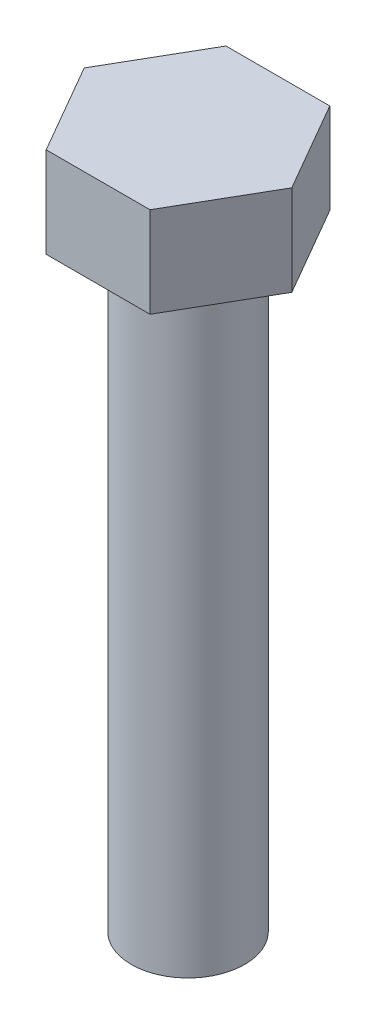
ISO-10303-21;
HEADER;
FILE_DESCRIPTION(('STEP AP214'),'2;1');
FILE_NAME('part.step','',(''),(''),'','','');
FILE_SCHEMA(('AUTOMOTIVE_DESIGN { 1 0 10303 214 1 1 1 1 }'));
ENDSEC;
DATA;
#1=APPLICATION_CONTEXT('core data for automotive mechanical design processes');
#2=APPLICATION_PROTOCOL_DEFINITION('international standard','automotive_design',2000,#1);
#3=PRODUCT_CONTEXT('',#1,'mechanical');
#4=PRODUCT('Part','Part','',(#3));
#5=PRODUCT_RELATED_PRODUCT_CATEGORY('part','',(#4));
#6=PRODUCT_DEFINITION_FORMATION('','',#4);
#7=PRODUCT_DEFINITION_CONTEXT('part definition',#1,'design');
#8=PRODUCT_DEFINITION('design','',#6,#7);
#9=PRODUCT_DEFINITION_SHAPE('','',#8);
#10=(LENGTH_UNIT() NAMED_UNIT(*) SI_UNIT(.MILLI.,.METRE.));
#11=(NAMED_UNIT(*) PLANE_ANGLE_UNIT() SI_UNIT($,.RADIAN.));
#12=(NAMED_UNIT(*) SI_UNIT($,.STERADIAN.) SOLID_ANGLE_UNIT());
#13=UNCERTAINTY_MEASURE_WITH_UNIT(LENGTH_MEASURE(1.E-05),#10,'distance_accuracy_value','');
#14=(GEOMETRIC_REPRESENTATION_CONTEXT(3) GLOBAL_UNCERTAINTY_ASSIGNED_CONTEXT((#13)) GLOBAL_UNIT_ASSIGNED_CONTEXT((#10,
#11,#12)) REPRESENTATION_CONTEXT('',''));
#15=CARTESIAN_POINT('',(0.,0.,0.));
#16=DIRECTION('',(0.,0.,1.));
#17=DIRECTION('',(1.,0.,0.));
#18=AXIS2_PLACEMENT_3D('',#15,#16,#17);
#19=CARTESIAN_POINT('',(-17.4143274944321,30.3784,30.1625));
#20=DIRECTION('',(0.,0.,-1.));
#21=DIRECTION('',(-1.,0.,0.));
#22=AXIS2_PLACEMENT_3D('',#19,#20,#21);
#23=PLANE('',#22);
#24=DIRECTION('',(1.,0.,0.));
#25=VECTOR('',#24,1.);
#26=CARTESIAN_POINT('',(-17.4143274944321,0.,30.1625));
#27=LINE('',#26,#25);
#28=CARTESIAN_POINT('',(-17.4143274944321,0.,30.1625));
#29=VERTEX_POINT('',#28);
#30=CARTESIAN_POINT('',(17.4143274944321,0.,30.1625));
#31=VERTEX_POINT('',#30);
#32=EDGE_CURVE('E118',#29,#31,#27,.T.);
#33=ORIENTED_EDGE('',*,*,#32,.T.);
#34=DIRECTION('',(0.,-1.,0.));
#35=VECTOR('',#34,1.);
#36=CARTESIAN_POINT('',(17.4143274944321,30.3784,30.1625));
#37=LINE('',#36,#35);
#38=CARTESIAN_POINT('',(17.4143274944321,30.3784,30.1625));
#39=VERTEX_POINT('',#38);
#40=EDGE_CURVE('E11',#39,#31,#37,.T.);
#41=ORIENTED_EDGE('',*,*,#40,.F.);
#42=DIRECTION('',(1.,0.,0.));
#43=VECTOR('',#42,1.);
#44=CARTESIAN_POINT('',(-17.4143274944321,30.3784,30.1625));
#45=LINE('',#44,#43);
#46=CARTESIAN_POINT('',(-17.4143274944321,30.3784,30.1625));
#47=VERTEX_POINT('',#46);
#48=EDGE_CURVE('E129',#47,#39,#45,.T.);
#49=ORIENTED_EDGE('',*,*,#48,.F.);
#50=DIRECTION('',(0.,-1.,0.));
#51=VECTOR('',#50,1.);
#52=CARTESIAN_POINT('',(-17.4143274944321,30.3784,30.1625));
#53=LINE('',#52,#51);
#54=EDGE_CURVE('E114',#47,#29,#53,.T.);
#55=ORIENTED_EDGE('',*,*,#54,.T.);
#56=EDGE_LOOP('',(#33,#41,#49,#55));
#57=FACE_BOUND('',#56,.T.);
#58=ADVANCED_FACE('F34',(#57),#23,.F.);
#59=CARTESIAN_POINT('',(17.4143274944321,30.3784,30.1625));
#60=DIRECTION('',(-0.866025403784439,0.,-0.5));
#61=DIRECTION('',(-0.5,0.,0.866025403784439));
#62=AXIS2_PLACEMENT_3D('',#59,#60,#61);
#63=PLANE('',#62);
#64=DIRECTION('',(0.5,0.,-0.866025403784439));
#65=VECTOR('',#64,1.);
#66=CARTESIAN_POINT('',(17.4143274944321,0.,30.1625));
#67=LINE('',#66,#65);
#68=CARTESIAN_POINT('',(34.8286549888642,0.,0.));
#69=VERTEX_POINT('',#68);
#70=EDGE_CURVE('E121',#31,#69,#67,.T.);
#71=ORIENTED_EDGE('',*,*,#70,.T.);
#72=DIRECTION('',(0.,-1.,0.));
#73=VECTOR('',#72,1.);
#74=CARTESIAN_POINT('',(34.8286549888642,30.3784,0.));
#75=LINE('',#74,#73);
#76=CARTESIAN_POINT('',(34.8286549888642,30.3784,0.));
#77=VERTEX_POINT('',#76);
#78=EDGE_CURVE('E42',#77,#69,#75,.T.);
#79=ORIENTED_EDGE('',*,*,#78,.F.);
#80=DIRECTION('',(0.5,0.,-0.866025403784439));
#81=VECTOR('',#80,1.);
#82=CARTESIAN_POINT('',(17.4143274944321,30.3784,30.1625));
#83=LINE('',#82,#81);
#84=EDGE_CURVE('E87',#39,#77,#83,.T.);
#85=ORIENTED_EDGE('',*,*,#84,.F.);
#86=ORIENTED_EDGE('',*,*,#40,.T.);
#87=EDGE_LOOP('',(#71,#79,#85,#86));
#88=FACE_BOUND('',#87,.T.);
#89=ADVANCED_FACE('F153',(#88),#63,.F.);
#90=CARTESIAN_POINT('',(34.8286549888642,30.3784,0.));
#91=DIRECTION('',(-0.866025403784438,0.,0.5));
#92=DIRECTION('',(0.5,0.,0.866025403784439));
#93=AXIS2_PLACEMENT_3D('',#90,#91,#92);
#94=PLANE('',#93);
#95=DIRECTION('',(-0.5,0.,-0.866025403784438));
#96=VECTOR('',#95,1.);
#97=CARTESIAN_POINT('',(34.8286549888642,0.,0.));
#98=LINE('',#97,#96);
#99=CARTESIAN_POINT('',(17.4143274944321,0.,-30.1625));
#100=VERTEX_POINT('',#99);
#101=EDGE_CURVE('E124',#69,#100,#98,.T.);
#102=ORIENTED_EDGE('',*,*,#101,.T.);
#103=DIRECTION('',(0.,-1.,0.));
#104=VECTOR('',#103,1.);
#105=CARTESIAN_POINT('',(17.4143274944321,30.3784,-30.1625));
#106=LINE('',#105,#104);
#107=CARTESIAN_POINT('',(17.4143274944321,30.3784,-30.1625));
#108=VERTEX_POINT('',#107);
#109=EDGE_CURVE('E109',#108,#100,#106,.T.);
#110=ORIENTED_EDGE('',*,*,#109,.F.);
#111=DIRECTION('',(-0.5,0.,-0.866025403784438));
#112=VECTOR('',#111,1.);
#113=CARTESIAN_POINT('',(34.8286549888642,30.3784,0.));
#114=LINE('',#113,#112);
#115=EDGE_CURVE('E100',#77,#108,#114,.T.);
#116=ORIENTED_EDGE('',*,*,#115,.F.);
#117=ORIENTED_EDGE('',*,*,#78,.T.);
#118=EDGE_LOOP('',(#102,#110,#116,#117));
#119=FACE_BOUND('',#118,.T.);
#120=ADVANCED_FACE('F135',(#119),#94,.F.);
#121=CARTESIAN_POINT('',(17.4143274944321,30.3784,-30.1625));
#122=DIRECTION('',(0.,0.,1.));
#123=DIRECTION('',(1.,0.,0.));
#124=AXIS2_PLACEMENT_3D('',#121,#122,#123);
#125=PLANE('',#124);
#126=DIRECTION('',(-1.,0.,0.));
#127=VECTOR('',#126,1.);
#128=CARTESIAN_POINT('',(17.4143274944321,0.,-30.1625));
#129=LINE('',#128,#127);
#130=CARTESIAN_POINT('',(-17.4143274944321,0.,-30.1625));
#131=VERTEX_POINT('',#130);
#132=EDGE_CURVE('E108',#100,#131,#129,.T.);
#133=ORIENTED_EDGE('',*,*,#132,.T.);
#134=DIRECTION('',(0.,-1.,0.));
#135=VECTOR('',#134,1.);
#136=CARTESIAN_POINT('',(-17.4143274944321,30.3784,-30.1625));
#137=LINE('',#136,#135);
#138=CARTESIAN_POINT('',(-17.4143274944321,30.3784,-30.1625));
#139=VERTEX_POINT('',#138);
#140=EDGE_CURVE('E105',#139,#131,#137,.T.);
#141=ORIENTED_EDGE('',*,*,#140,.F.);
#142=DIRECTION('',(-1.,0.,0.));
#143=VECTOR('',#142,1.);
#144=CARTESIAN_POINT('',(17.4143274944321,30.3784,-30.1625));
#145=LINE('',#144,#143);
#146=EDGE_CURVE('E94',#108,#139,#145,.T.);
#147=ORIENTED_EDGE('',*,*,#146,.F.);
#148=ORIENTED_EDGE('',*,*,#109,.T.);
#149=EDGE_LOOP('',(#133,#141,#147,#148));
#150=FACE_BOUND('',#149,.T.);
#151=ADVANCED_FACE('F106',(#150),#125,.F.);
#152=CARTESIAN_POINT('',(-17.4143274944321,30.3784,-30.1625));
#153=DIRECTION('',(0.866025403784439,0.,0.5));
#154=DIRECTION('',(0.5,0.,-0.866025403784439));
#155=AXIS2_PLACEMENT_3D('',#152,#153,#154);
#156=PLANE('',#155);
#157=DIRECTION('',(-0.5,0.,0.866025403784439));
#158=VECTOR('',#157,1.);
#159=CARTESIAN_POINT('',(-17.4143274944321,0.,-30.1625));
#160=LINE('',#159,#158);
#161=CARTESIAN_POINT('',(-34.8286549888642,0.,0.));
#162=VERTEX_POINT('',#161);
#163=EDGE_CURVE('E73',#131,#162,#160,.T.);
#164=ORIENTED_EDGE('',*,*,#163,.T.);
#165=DIRECTION('',(0.,-1.,0.));
#166=VECTOR('',#165,1.);
#167=CARTESIAN_POINT('',(-34.8286549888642,30.3784,0.));
#168=LINE('',#167,#166);
#169=CARTESIAN_POINT('',(-34.8286549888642,30.3784,0.));
#170=VERTEX_POINT('',#169);
#171=EDGE_CURVE('E110',#170,#162,#168,.T.);
#172=ORIENTED_EDGE('',*,*,#171,.F.);
#173=DIRECTION('',(-0.5,0.,0.866025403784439));
#174=VECTOR('',#173,1.);
#175=CARTESIAN_POINT('',(-17.4143274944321,30.3784,-30.1625));
#176=LINE('',#175,#174);
#177=EDGE_CURVE('E98',#139,#170,#176,.T.);
#178=ORIENTED_EDGE('',*,*,#177,.F.);
#179=ORIENTED_EDGE('',*,*,#140,.T.);
#180=EDGE_LOOP('',(#164,#172,#178,#179));
#181=FACE_BOUND('',#180,.T.);
#182=ADVANCED_FACE('F112',(#181),#156,.F.);
#183=CARTESIAN_POINT('',(-34.8286549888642,30.3784,0.));
#184=DIRECTION('',(0.866025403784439,0.,-0.5));
#185=DIRECTION('',(-0.5,0.,-0.866025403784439));
#186=AXIS2_PLACEMENT_3D('',#183,#184,#185);
#187=PLANE('',#186);
#188=DIRECTION('',(0.5,0.,0.866025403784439));
#189=VECTOR('',#188,1.);
#190=CARTESIAN_POINT('',(-34.8286549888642,0.,0.));
#191=LINE('',#190,#189);
#192=EDGE_CURVE('E79',#162,#29,#191,.T.);
#193=ORIENTED_EDGE('',*,*,#192,.T.);
#194=ORIENTED_EDGE('',*,*,#54,.F.);
#195=DIRECTION('',(0.5,0.,0.866025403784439));
#196=VECTOR('',#195,1.);
#197=CARTESIAN_POINT('',(-34.8286549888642,30.3784,0.));
#198=LINE('',#197,#196);
#199=EDGE_CURVE('E50',#170,#47,#198,.T.);
#200=ORIENTED_EDGE('',*,*,#199,.F.);
#201=ORIENTED_EDGE('',*,*,#171,.T.);
#202=EDGE_LOOP('',(#193,#194,#200,#201));
#203=FACE_BOUND('',#202,.T.);
#204=ADVANCED_FACE('F142',(#203),#187,.F.);
#205=CARTESIAN_POINT('',(0.,30.3784,0.));
#206=DIRECTION('',(0.,1.,0.));
#207=DIRECTION('',(0.,0.,1.));
#208=AXIS2_PLACEMENT_3D('',#205,#206,#207);
#209=PLANE('',#208);
#210=ORIENTED_EDGE('',*,*,#48,.T.);
#211=ORIENTED_EDGE('',*,*,#84,.T.);
#212=ORIENTED_EDGE('',*,*,#115,.T.);
#213=ORIENTED_EDGE('',*,*,#146,.T.);
#214=ORIENTED_EDGE('',*,*,#177,.T.);
#215=ORIENTED_EDGE('',*,*,#199,.T.);
#216=EDGE_LOOP('',(#210,#211,#212,#213,#214,#215));
#217=FACE_BOUND('',#216,.T.);
#218=ADVANCED_FACE('F96',(#217),#209,.T.);
#219=CARTESIAN_POINT('',(0.,0.,0.));
#220=DIRECTION('',(0.,1.,0.));
#221=DIRECTION('',(0.,0.,1.));
#222=AXIS2_PLACEMENT_3D('',#219,#220,#221);
#223=PLANE('',#222);
#224=CARTESIAN_POINT('',(0.,0.,0.));
#225=DIRECTION('',(0.,1.,0.));
#226=DIRECTION('',(0.,0.,1.));
#227=AXIS2_PLACEMENT_3D('',#224,#225,#226);
#228=CIRCLE('',#227,19.05);
#229=CARTESIAN_POINT('',(0.,0.,19.05));
#230=VERTEX_POINT('',#229);
#231=EDGE_CURVE('E215',#230,#230,#228,.T.);
#232=ORIENTED_EDGE('',*,*,#231,.T.);
#233=EDGE_LOOP('',(#232));
#234=FACE_BOUND('',#233,.T.);
#235=ORIENTED_EDGE('',*,*,#32,.F.);
#236=ORIENTED_EDGE('',*,*,#192,.F.);
#237=ORIENTED_EDGE('',*,*,#163,.F.);
#238=ORIENTED_EDGE('',*,*,#132,.F.);
#239=ORIENTED_EDGE('',*,*,#101,.F.);
#240=ORIENTED_EDGE('',*,*,#70,.F.);
#241=EDGE_LOOP('',(#235,#236,#237,#238,#239,#240));
#242=FACE_BOUND('',#241,.T.);
#243=ADVANCED_FACE('F138',(#234,#242),#223,.F.);
#244=CARTESIAN_POINT('',(0.,-203.2,0.));
#245=DIRECTION('',(0.,1.,0.));
#246=DIRECTION('',(0.,0.,1.));
#247=AXIS2_PLACEMENT_3D('',#244,#245,#246);
#248=CYLINDRICAL_SURFACE('',#247,19.05);
#249=CARTESIAN_POINT('',(0.,-203.2,0.));
#250=DIRECTION('',(0.,1.,0.));
#251=DIRECTION('',(0.,0.,1.));
#252=AXIS2_PLACEMENT_3D('',#249,#250,#251);
#253=CIRCLE('',#252,19.05);
#254=CARTESIAN_POINT('',(0.,-203.2,19.05));
#255=VERTEX_POINT('',#254);
#256=EDGE_CURVE('E122',#255,#255,#253,.T.);
#257=ORIENTED_EDGE('',*,*,#256,.T.);
#258=EDGE_LOOP('',(#257));
#259=FACE_BOUND('',#258,.T.);
#260=ORIENTED_EDGE('',*,*,#231,.F.);
#261=EDGE_LOOP('',(#260));
#262=FACE_BOUND('',#261,.T.);
#263=ADVANCED_FACE('F190',(#259,#262),#248,.T.);
#264=CARTESIAN_POINT('',(0.,-203.2,0.));
#265=DIRECTION('',(0.,1.,0.));
#266=DIRECTION('',(0.,0.,1.));
#267=AXIS2_PLACEMENT_3D('',#264,#265,#266);
#268=PLANE('',#267);
#269=ORIENTED_EDGE('',*,*,#256,.F.);
#270=EDGE_LOOP('',(#269));
#271=FACE_BOUND('',#270,.T.);
#272=ADVANCED_FACE('F199',(#271),#268,.F.);
#273=CLOSED_SHELL('',(#58,#89,#120,#151,#182,#204,#218,#243,#263,#272));
#274=MANIFOLD_SOLID_BREP('B2',#273);
#275=ADVANCED_BREP_SHAPE_REPRESENTATION('',(#18,#274),#14);
#276=SHAPE_DEFINITION_REPRESENTATION(#9,#275);
ENDSEC;
END-ISO-10303-21;
